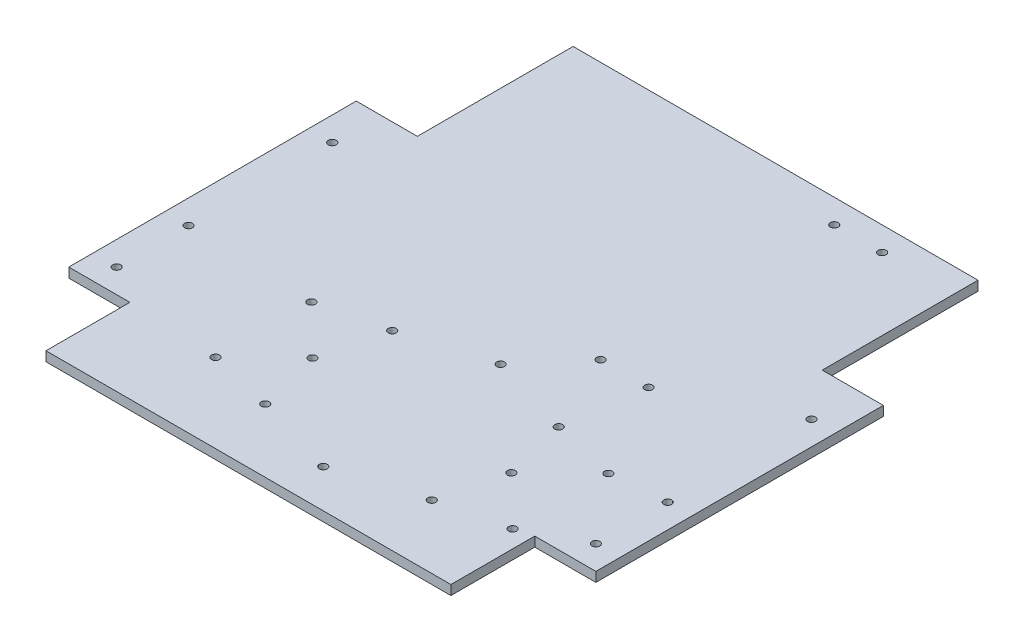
ISO-10303-21;
HEADER;
FILE_DESCRIPTION(('STEP AP214'),'2;1');
FILE_NAME('part.step','',(''),(''),'','','');
FILE_SCHEMA(('AUTOMOTIVE_DESIGN { 1 0 10303 214 1 1 1 1 }'));
ENDSEC;
DATA;
#1=APPLICATION_CONTEXT('core data for automotive mechanical design processes');
#2=APPLICATION_PROTOCOL_DEFINITION('international standard','automotive_design',2000,#1);
#3=PRODUCT_CONTEXT('',#1,'mechanical');
#4=PRODUCT('Part','Part','',(#3));
#5=PRODUCT_RELATED_PRODUCT_CATEGORY('part','',(#4));
#6=PRODUCT_DEFINITION_FORMATION('','',#4);
#7=PRODUCT_DEFINITION_CONTEXT('part definition',#1,'design');
#8=PRODUCT_DEFINITION('design','',#6,#7);
#9=PRODUCT_DEFINITION_SHAPE('','',#8);
#10=(LENGTH_UNIT() NAMED_UNIT(*) SI_UNIT(.MILLI.,.METRE.));
#11=(NAMED_UNIT(*) PLANE_ANGLE_UNIT() SI_UNIT($,.RADIAN.));
#12=(NAMED_UNIT(*) SI_UNIT($,.STERADIAN.) SOLID_ANGLE_UNIT());
#13=UNCERTAINTY_MEASURE_WITH_UNIT(LENGTH_MEASURE(1.E-05),#10,'distance_accuracy_value','');
#14=(GEOMETRIC_REPRESENTATION_CONTEXT(3) GLOBAL_UNCERTAINTY_ASSIGNED_CONTEXT((#13)) GLOBAL_UNIT_ASSIGNED_CONTEXT((#10,
#11,#12)) REPRESENTATION_CONTEXT('',''));
#15=CARTESIAN_POINT('',(0.,0.,0.));
#16=DIRECTION('',(0.,0.,1.));
#17=DIRECTION('',(1.,0.,0.));
#18=AXIS2_PLACEMENT_3D('',#15,#16,#17);
#19=CARTESIAN_POINT('',(84.5,-16.,0.));
#20=DIRECTION('',(-1.,0.,0.));
#21=DIRECTION('',(0.,1.,0.));
#22=AXIS2_PLACEMENT_3D('',#19,#20,#21);
#23=PLANE('',#22);
#24=DIRECTION('',(0.,0.,-1.));
#25=VECTOR('',#24,1.);
#26=CARTESIAN_POINT('',(84.5,0.,0.));
#27=LINE('',#26,#25);
#28=CARTESIAN_POINT('',(84.5,0.,-45.));
#29=VERTEX_POINT('',#28);
#30=CARTESIAN_POINT('',(84.5,0.,-110.));
#31=VERTEX_POINT('',#30);
#32=EDGE_CURVE('E271',#29,#31,#27,.T.);
#33=ORIENTED_EDGE('',*,*,#32,.T.);
#34=DIRECTION('',(0.,-1.,0.));
#35=VECTOR('',#34,1.);
#36=CARTESIAN_POINT('',(84.5,4.,-110.));
#37=LINE('',#36,#35);
#38=CARTESIAN_POINT('',(84.5,4.,-110.));
#39=VERTEX_POINT('',#38);
#40=EDGE_CURVE('E165',#39,#31,#37,.T.);
#41=ORIENTED_EDGE('',*,*,#40,.F.);
#42=DIRECTION('',(0.,0.,1.));
#43=VECTOR('',#42,1.);
#44=CARTESIAN_POINT('',(84.5,4.,0.));
#45=LINE('',#44,#43);
#46=CARTESIAN_POINT('',(84.5,4.,-45.));
#47=VERTEX_POINT('',#46);
#48=EDGE_CURVE('E206',#39,#47,#45,.T.);
#49=ORIENTED_EDGE('',*,*,#48,.T.);
#50=DIRECTION('',(0.,1.,0.));
#51=VECTOR('',#50,1.);
#52=CARTESIAN_POINT('',(84.5,-16.,-45.));
#53=LINE('',#52,#51);
#54=EDGE_CURVE('E11',#29,#47,#53,.T.);
#55=ORIENTED_EDGE('',*,*,#54,.F.);
#56=EDGE_LOOP('',(#33,#41,#49,#55));
#57=FACE_BOUND('',#56,.T.);
#58=ADVANCED_FACE('F17',(#57),#23,.F.);
#59=CARTESIAN_POINT('',(0.,-16.,-45.));
#60=DIRECTION('',(0.,0.,-1.));
#61=DIRECTION('',(0.,-1.,0.));
#62=AXIS2_PLACEMENT_3D('',#59,#60,#61);
#63=PLANE('',#62);
#64=ORIENTED_EDGE('',*,*,#54,.T.);
#65=DIRECTION('',(-1.,0.,0.));
#66=VECTOR('',#65,1.);
#67=CARTESIAN_POINT('',(0.,4.,-45.));
#68=LINE('',#67,#66);
#69=CARTESIAN_POINT('',(110.,4.,-45.));
#70=VERTEX_POINT('',#69);
#71=EDGE_CURVE('E281',#70,#47,#68,.T.);
#72=ORIENTED_EDGE('',*,*,#71,.F.);
#73=DIRECTION('',(0.,1.,0.));
#74=VECTOR('',#73,1.);
#75=CARTESIAN_POINT('',(110.,-16.,-45.));
#76=LINE('',#75,#74);
#77=CARTESIAN_POINT('',(110.,0.,-45.));
#78=VERTEX_POINT('',#77);
#79=EDGE_CURVE('E160',#78,#70,#76,.T.);
#80=ORIENTED_EDGE('',*,*,#79,.F.);
#81=DIRECTION('',(1.,0.,0.));
#82=VECTOR('',#81,1.);
#83=CARTESIAN_POINT('',(0.,0.,-45.));
#84=LINE('',#83,#82);
#85=EDGE_CURVE('E275',#29,#78,#84,.T.);
#86=ORIENTED_EDGE('',*,*,#85,.F.);
#87=EDGE_LOOP('',(#64,#72,#80,#86));
#88=FACE_BOUND('',#87,.T.);
#89=ADVANCED_FACE('F512',(#88),#63,.T.);
#90=CARTESIAN_POINT('',(0.,-16.,-45.));
#91=DIRECTION('',(0.,0.,1.));
#92=DIRECTION('',(1.,0.,0.));
#93=AXIS2_PLACEMENT_3D('',#90,#91,#92);
#94=PLANE('',#93);
#95=DIRECTION('',(-1.,0.,0.));
#96=VECTOR('',#95,1.);
#97=CARTESIAN_POINT('',(0.,0.,-45.));
#98=LINE('',#97,#96);
#99=CARTESIAN_POINT('',(-84.5,0.,-45.));
#100=VERTEX_POINT('',#99);
#101=CARTESIAN_POINT('',(-110.,0.,-45.));
#102=VERTEX_POINT('',#101);
#103=EDGE_CURVE('E133',#100,#102,#98,.T.);
#104=ORIENTED_EDGE('',*,*,#103,.T.);
#105=DIRECTION('',(0.,-1.,0.));
#106=VECTOR('',#105,1.);
#107=CARTESIAN_POINT('',(-110.,4.,-45.));
#108=LINE('',#107,#106);
#109=CARTESIAN_POINT('',(-110.,4.,-45.));
#110=VERTEX_POINT('',#109);
#111=EDGE_CURVE('E118',#110,#102,#108,.T.);
#112=ORIENTED_EDGE('',*,*,#111,.F.);
#113=DIRECTION('',(1.,0.,0.));
#114=VECTOR('',#113,1.);
#115=CARTESIAN_POINT('',(0.,4.,-45.));
#116=LINE('',#115,#114);
#117=CARTESIAN_POINT('',(-84.5,4.,-45.));
#118=VERTEX_POINT('',#117);
#119=EDGE_CURVE('E192',#110,#118,#116,.T.);
#120=ORIENTED_EDGE('',*,*,#119,.T.);
#121=DIRECTION('',(0.,1.,0.));
#122=VECTOR('',#121,1.);
#123=CARTESIAN_POINT('',(-84.5,-16.,-45.));
#124=LINE('',#123,#122);
#125=EDGE_CURVE('E26',#100,#118,#124,.T.);
#126=ORIENTED_EDGE('',*,*,#125,.F.);
#127=EDGE_LOOP('',(#104,#112,#120,#126));
#128=FACE_BOUND('',#127,.T.);
#129=ADVANCED_FACE('F134',(#128),#94,.F.);
#130=CARTESIAN_POINT('',(-84.5,-16.,0.));
#131=DIRECTION('',(-1.,0.,0.));
#132=DIRECTION('',(0.,0.,1.));
#133=AXIS2_PLACEMENT_3D('',#130,#131,#132);
#134=PLANE('',#133);
#135=ORIENTED_EDGE('',*,*,#125,.T.);
#136=DIRECTION('',(0.,0.,1.));
#137=VECTOR('',#136,1.);
#138=CARTESIAN_POINT('',(-84.5,4.,0.));
#139=LINE('',#138,#137);
#140=CARTESIAN_POINT('',(-84.5,4.,-110.));
#141=VERTEX_POINT('',#140);
#142=EDGE_CURVE('E188',#141,#118,#139,.T.);
#143=ORIENTED_EDGE('',*,*,#142,.F.);
#144=DIRECTION('',(0.,1.,0.));
#145=VECTOR('',#144,1.);
#146=CARTESIAN_POINT('',(-84.5,-16.,-110.));
#147=LINE('',#146,#145);
#148=CARTESIAN_POINT('',(-84.5,0.,-110.));
#149=VERTEX_POINT('',#148);
#150=EDGE_CURVE('E40',#149,#141,#147,.T.);
#151=ORIENTED_EDGE('',*,*,#150,.F.);
#152=DIRECTION('',(0.,0.,-1.));
#153=VECTOR('',#152,1.);
#154=CARTESIAN_POINT('',(-84.5,0.,0.));
#155=LINE('',#154,#153);
#156=EDGE_CURVE('E139',#100,#149,#155,.T.);
#157=ORIENTED_EDGE('',*,*,#156,.F.);
#158=EDGE_LOOP('',(#135,#143,#151,#157));
#159=FACE_BOUND('',#158,.T.);
#160=ADVANCED_FACE('F186',(#159),#134,.T.);
#161=CARTESIAN_POINT('',(-84.5,-16.,0.));
#162=DIRECTION('',(1.,0.,0.));
#163=DIRECTION('',(0.,0.,-1.));
#164=AXIS2_PLACEMENT_3D('',#161,#162,#163);
#165=PLANE('',#164);
#166=DIRECTION('',(0.,0.,1.));
#167=VECTOR('',#166,1.);
#168=CARTESIAN_POINT('',(-84.5,0.,0.));
#169=LINE('',#168,#167);
#170=CARTESIAN_POINT('',(-84.5,0.,75.));
#171=VERTEX_POINT('',#170);
#172=CARTESIAN_POINT('',(-84.5,0.,110.));
#173=VERTEX_POINT('',#172);
#174=EDGE_CURVE('E151',#171,#173,#169,.T.);
#175=ORIENTED_EDGE('',*,*,#174,.T.);
#176=DIRECTION('',(0.,-1.,0.));
#177=VECTOR('',#176,1.);
#178=CARTESIAN_POINT('',(-84.5,4.,110.));
#179=LINE('',#178,#177);
#180=CARTESIAN_POINT('',(-84.5,4.,110.));
#181=VERTEX_POINT('',#180);
#182=EDGE_CURVE('E130',#181,#173,#179,.T.);
#183=ORIENTED_EDGE('',*,*,#182,.F.);
#184=DIRECTION('',(0.,0.,-1.));
#185=VECTOR('',#184,1.);
#186=CARTESIAN_POINT('',(-84.5,4.,0.));
#187=LINE('',#186,#185);
#188=CARTESIAN_POINT('',(-84.5,4.,75.));
#189=VERTEX_POINT('',#188);
#190=EDGE_CURVE('E310',#181,#189,#187,.T.);
#191=ORIENTED_EDGE('',*,*,#190,.T.);
#192=DIRECTION('',(0.,1.,0.));
#193=VECTOR('',#192,1.);
#194=CARTESIAN_POINT('',(-84.5,-16.,75.));
#195=LINE('',#194,#193);
#196=EDGE_CURVE('E181',#171,#189,#195,.T.);
#197=ORIENTED_EDGE('',*,*,#196,.F.);
#198=EDGE_LOOP('',(#175,#183,#191,#197));
#199=FACE_BOUND('',#198,.T.);
#200=ADVANCED_FACE('F337',(#199),#165,.F.);
#201=CARTESIAN_POINT('',(0.,-16.,75.));
#202=DIRECTION('',(0.,0.,1.));
#203=DIRECTION('',(1.,0.,0.));
#204=AXIS2_PLACEMENT_3D('',#201,#202,#203);
#205=PLANE('',#204);
#206=ORIENTED_EDGE('',*,*,#196,.T.);
#207=DIRECTION('',(1.,0.,0.));
#208=VECTOR('',#207,1.);
#209=CARTESIAN_POINT('',(0.,4.,75.));
#210=LINE('',#209,#208);
#211=CARTESIAN_POINT('',(-110.,4.,75.));
#212=VERTEX_POINT('',#211);
#213=EDGE_CURVE('E306',#212,#189,#210,.T.);
#214=ORIENTED_EDGE('',*,*,#213,.F.);
#215=DIRECTION('',(0.,1.,0.));
#216=VECTOR('',#215,1.);
#217=CARTESIAN_POINT('',(-110.,-16.,75.));
#218=LINE('',#217,#216);
#219=CARTESIAN_POINT('',(-110.,0.,75.));
#220=VERTEX_POINT('',#219);
#221=EDGE_CURVE('E110',#220,#212,#218,.T.);
#222=ORIENTED_EDGE('',*,*,#221,.F.);
#223=DIRECTION('',(-1.,0.,0.));
#224=VECTOR('',#223,1.);
#225=CARTESIAN_POINT('',(0.,0.,75.));
#226=LINE('',#225,#224);
#227=EDGE_CURVE('E144',#171,#220,#226,.T.);
#228=ORIENTED_EDGE('',*,*,#227,.F.);
#229=EDGE_LOOP('',(#206,#214,#222,#228));
#230=FACE_BOUND('',#229,.T.);
#231=ADVANCED_FACE('F539',(#230),#205,.T.);
#232=CARTESIAN_POINT('',(0.,-16.,75.));
#233=DIRECTION('',(0.,0.,-1.));
#234=DIRECTION('',(0.,-1.,0.));
#235=AXIS2_PLACEMENT_3D('',#232,#233,#234);
#236=PLANE('',#235);
#237=DIRECTION('',(1.,0.,0.));
#238=VECTOR('',#237,1.);
#239=CARTESIAN_POINT('',(0.,0.,75.));
#240=LINE('',#239,#238);
#241=CARTESIAN_POINT('',(84.5,0.,75.));
#242=VERTEX_POINT('',#241);
#243=CARTESIAN_POINT('',(110.,0.,75.));
#244=VERTEX_POINT('',#243);
#245=EDGE_CURVE('E328',#242,#244,#240,.T.);
#246=ORIENTED_EDGE('',*,*,#245,.T.);
#247=DIRECTION('',(0.,1.,0.));
#248=VECTOR('',#247,1.);
#249=CARTESIAN_POINT('',(110.,-16.,75.));
#250=LINE('',#249,#248);
#251=CARTESIAN_POINT('',(110.,4.,75.));
#252=VERTEX_POINT('',#251);
#253=EDGE_CURVE('E161',#244,#252,#250,.T.);
#254=ORIENTED_EDGE('',*,*,#253,.T.);
#255=DIRECTION('',(-1.,0.,0.));
#256=VECTOR('',#255,1.);
#257=CARTESIAN_POINT('',(0.,4.,75.));
#258=LINE('',#257,#256);
#259=CARTESIAN_POINT('',(84.5,4.,75.));
#260=VERTEX_POINT('',#259);
#261=EDGE_CURVE('E370',#252,#260,#258,.T.);
#262=ORIENTED_EDGE('',*,*,#261,.T.);
#263=DIRECTION('',(0.,1.,0.));
#264=VECTOR('',#263,1.);
#265=CARTESIAN_POINT('',(84.5,-16.,75.));
#266=LINE('',#265,#264);
#267=EDGE_CURVE('E178',#242,#260,#266,.T.);
#268=ORIENTED_EDGE('',*,*,#267,.F.);
#269=EDGE_LOOP('',(#246,#254,#262,#268));
#270=FACE_BOUND('',#269,.T.);
#271=ADVANCED_FACE('F368',(#270),#236,.F.);
#272=CARTESIAN_POINT('',(84.5,-16.,0.));
#273=DIRECTION('',(1.,0.,0.));
#274=DIRECTION('',(0.,1.,0.));
#275=AXIS2_PLACEMENT_3D('',#272,#273,#274);
#276=PLANE('',#275);
#277=ORIENTED_EDGE('',*,*,#267,.T.);
#278=DIRECTION('',(0.,0.,-1.));
#279=VECTOR('',#278,1.);
#280=CARTESIAN_POINT('',(84.5,4.,0.));
#281=LINE('',#280,#279);
#282=CARTESIAN_POINT('',(84.5,4.,110.));
#283=VERTEX_POINT('',#282);
#284=EDGE_CURVE('E318',#283,#260,#281,.T.);
#285=ORIENTED_EDGE('',*,*,#284,.F.);
#286=DIRECTION('',(0.,-1.,0.));
#287=VECTOR('',#286,1.);
#288=CARTESIAN_POINT('',(84.5,4.,110.));
#289=LINE('',#288,#287);
#290=CARTESIAN_POINT('',(84.5,0.,110.));
#291=VERTEX_POINT('',#290);
#292=EDGE_CURVE('E174',#283,#291,#289,.T.);
#293=ORIENTED_EDGE('',*,*,#292,.T.);
#294=DIRECTION('',(0.,0.,1.));
#295=VECTOR('',#294,1.);
#296=CARTESIAN_POINT('',(84.5,0.,0.));
#297=LINE('',#296,#295);
#298=EDGE_CURVE('E323',#242,#291,#297,.T.);
#299=ORIENTED_EDGE('',*,*,#298,.F.);
#300=EDGE_LOOP('',(#277,#285,#293,#299));
#301=FACE_BOUND('',#300,.T.);
#302=ADVANCED_FACE('F534',(#301),#276,.T.);
#303=CARTESIAN_POINT('',(-110.,4.,110.));
#304=DIRECTION('',(0.,0.,-1.));
#305=DIRECTION('',(0.,-1.,0.));
#306=AXIS2_PLACEMENT_3D('',#303,#304,#305);
#307=PLANE('',#306);
#308=DIRECTION('',(1.,0.,0.));
#309=VECTOR('',#308,1.);
#310=CARTESIAN_POINT('',(-110.,4.,110.));
#311=LINE('',#310,#309);
#312=EDGE_CURVE('E314',#181,#283,#311,.T.);
#313=ORIENTED_EDGE('',*,*,#312,.F.);
#314=ORIENTED_EDGE('',*,*,#182,.T.);
#315=DIRECTION('',(1.,0.,0.));
#316=VECTOR('',#315,1.);
#317=CARTESIAN_POINT('',(-110.,0.,110.));
#318=LINE('',#317,#316);
#319=EDGE_CURVE('E327',#173,#291,#318,.T.);
#320=ORIENTED_EDGE('',*,*,#319,.T.);
#321=ORIENTED_EDGE('',*,*,#292,.F.);
#322=EDGE_LOOP('',(#313,#314,#320,#321));
#323=FACE_BOUND('',#322,.T.);
#324=ADVANCED_FACE('F342',(#323),#307,.F.);
#325=CARTESIAN_POINT('',(-110.,4.,110.));
#326=DIRECTION('',(1.,0.,0.));
#327=DIRECTION('',(0.,1.,0.));
#328=AXIS2_PLACEMENT_3D('',#325,#326,#327);
#329=PLANE('',#328);
#330=ORIENTED_EDGE('',*,*,#221,.T.);
#331=DIRECTION('',(0.,0.,1.));
#332=VECTOR('',#331,1.);
#333=CARTESIAN_POINT('',(-110.,4.,110.));
#334=LINE('',#333,#332);
#335=EDGE_CURVE('E125',#110,#212,#334,.T.);
#336=ORIENTED_EDGE('',*,*,#335,.F.);
#337=ORIENTED_EDGE('',*,*,#111,.T.);
#338=DIRECTION('',(0.,0.,1.));
#339=VECTOR('',#338,1.);
#340=CARTESIAN_POINT('',(-110.,0.,110.));
#341=LINE('',#340,#339);
#342=EDGE_CURVE('E122',#102,#220,#341,.T.);
#343=ORIENTED_EDGE('',*,*,#342,.T.);
#344=EDGE_LOOP('',(#330,#336,#337,#343));
#345=FACE_BOUND('',#344,.T.);
#346=ADVANCED_FACE('F120',(#345),#329,.F.);
#347=CARTESIAN_POINT('',(-110.,4.,-110.));
#348=DIRECTION('',(0.,0.,1.));
#349=DIRECTION('',(1.,0.,0.));
#350=AXIS2_PLACEMENT_3D('',#347,#348,#349);
#351=PLANE('',#350);
#352=DIRECTION('',(-1.,0.,0.));
#353=VECTOR('',#352,1.);
#354=CARTESIAN_POINT('',(-110.,4.,-110.));
#355=LINE('',#354,#353);
#356=EDGE_CURVE('E200',#39,#141,#355,.T.);
#357=ORIENTED_EDGE('',*,*,#356,.F.);
#358=ORIENTED_EDGE('',*,*,#40,.T.);
#359=DIRECTION('',(-1.,0.,0.));
#360=VECTOR('',#359,1.);
#361=CARTESIAN_POINT('',(-110.,0.,-110.));
#362=LINE('',#361,#360);
#363=EDGE_CURVE('E157',#31,#149,#362,.T.);
#364=ORIENTED_EDGE('',*,*,#363,.T.);
#365=ORIENTED_EDGE('',*,*,#150,.T.);
#366=EDGE_LOOP('',(#357,#358,#364,#365));
#367=FACE_BOUND('',#366,.T.);
#368=ADVANCED_FACE('F521',(#367),#351,.F.);
#369=CARTESIAN_POINT('',(110.,4.,110.));
#370=DIRECTION('',(-1.,0.,0.));
#371=DIRECTION('',(0.,0.,1.));
#372=AXIS2_PLACEMENT_3D('',#369,#370,#371);
#373=PLANE('',#372);
#374=ORIENTED_EDGE('',*,*,#79,.T.);
#375=DIRECTION('',(0.,0.,-1.));
#376=VECTOR('',#375,1.);
#377=CARTESIAN_POINT('',(110.,4.,110.));
#378=LINE('',#377,#376);
#379=EDGE_CURVE('E276',#252,#70,#378,.T.);
#380=ORIENTED_EDGE('',*,*,#379,.F.);
#381=ORIENTED_EDGE('',*,*,#253,.F.);
#382=DIRECTION('',(0.,0.,-1.));
#383=VECTOR('',#382,1.);
#384=CARTESIAN_POINT('',(110.,0.,110.));
#385=LINE('',#384,#383);
#386=EDGE_CURVE('E322',#244,#78,#385,.T.);
#387=ORIENTED_EDGE('',*,*,#386,.T.);
#388=EDGE_LOOP('',(#374,#380,#381,#387));
#389=FACE_BOUND('',#388,.T.);
#390=ADVANCED_FACE('F376',(#389),#373,.F.);
#391=CARTESIAN_POINT('',(0.,0.,0.));
#392=DIRECTION('',(0.,-1.,0.));
#393=DIRECTION('',(0.,0.,-1.));
#394=AXIS2_PLACEMENT_3D('',#391,#392,#393);
#395=PLANE('',#394);
#396=CARTESIAN_POINT('',(-100.,0.,35.));
#397=DIRECTION('',(0.,1.,0.));
#398=DIRECTION('',(0.,0.,1.));
#399=AXIS2_PLACEMENT_3D('',#396,#397,#398);
#400=CIRCLE('',#399,1.65);
#401=CARTESIAN_POINT('',(-100.,0.,36.65));
#402=VERTEX_POINT('',#401);
#403=EDGE_CURVE('E280',#402,#402,#400,.T.);
#404=ORIENTED_EDGE('',*,*,#403,.T.);
#405=EDGE_LOOP('',(#404));
#406=FACE_BOUND('',#405,.T.);
#407=CARTESIAN_POINT('',(100.,0.,-25.));
#408=DIRECTION('',(0.,1.,0.));
#409=DIRECTION('',(0.,0.,1.));
#410=AXIS2_PLACEMENT_3D('',#407,#408,#409);
#411=CIRCLE('',#410,1.65);
#412=CARTESIAN_POINT('',(100.,0.,-23.35));
#413=VERTEX_POINT('',#412);
#414=EDGE_CURVE('E291',#413,#413,#411,.T.);
#415=ORIENTED_EDGE('',*,*,#414,.T.);
#416=EDGE_LOOP('',(#415));
#417=FACE_BOUND('',#416,.T.);
#418=CARTESIAN_POINT('',(-100.,0.,65.));
#419=DIRECTION('',(0.,1.,0.));
#420=DIRECTION('',(0.,0.,1.));
#421=AXIS2_PLACEMENT_3D('',#418,#419,#420);
#422=CIRCLE('',#421,1.65);
#423=CARTESIAN_POINT('',(-100.,0.,66.65));
#424=VERTEX_POINT('',#423);
#425=EDGE_CURVE('E221',#424,#424,#422,.T.);
#426=ORIENTED_EDGE('',*,*,#425,.T.);
#427=EDGE_LOOP('',(#426));
#428=FACE_BOUND('',#427,.T.);
#429=CARTESIAN_POINT('',(-100.,0.,-25.));
#430=DIRECTION('',(0.,1.,0.));
#431=DIRECTION('',(0.,0.,1.));
#432=AXIS2_PLACEMENT_3D('',#429,#430,#431);
#433=CIRCLE('',#432,1.65);
#434=CARTESIAN_POINT('',(-100.,0.,-23.35));
#435=VERTEX_POINT('',#434);
#436=EDGE_CURVE('E284',#435,#435,#433,.T.);
#437=ORIENTED_EDGE('',*,*,#436,.T.);
#438=EDGE_LOOP('',(#437));
#439=FACE_BOUND('',#438,.T.);
#440=CARTESIAN_POINT('',(100.,0.,65.));
#441=DIRECTION('',(0.,1.,0.));
#442=DIRECTION('',(0.,0.,1.));
#443=AXIS2_PLACEMENT_3D('',#440,#441,#442);
#444=CIRCLE('',#443,1.65);
#445=CARTESIAN_POINT('',(100.,0.,66.65));
#446=VERTEX_POINT('',#445);
#447=EDGE_CURVE('E222',#446,#446,#444,.T.);
#448=ORIENTED_EDGE('',*,*,#447,.T.);
#449=EDGE_LOOP('',(#448));
#450=FACE_BOUND('',#449,.T.);
#451=CARTESIAN_POINT('',(100.,0.,35.));
#452=DIRECTION('',(0.,1.,0.));
#453=DIRECTION('',(0.,0.,1.));
#454=AXIS2_PLACEMENT_3D('',#451,#452,#453);
#455=CIRCLE('',#454,1.65);
#456=CARTESIAN_POINT('',(100.,0.,36.65));
#457=VERTEX_POINT('',#456);
#458=EDGE_CURVE('E257',#457,#457,#455,.T.);
#459=ORIENTED_EDGE('',*,*,#458,.T.);
#460=EDGE_LOOP('',(#459));
#461=FACE_BOUND('',#460,.T.);
#462=CARTESIAN_POINT('',(-19.5,0.,30.5));
#463=DIRECTION('',(0.,1.,0.));
#464=DIRECTION('',(0.,0.,1.));
#465=AXIS2_PLACEMENT_3D('',#462,#463,#464);
#466=CIRCLE('',#465,1.65);
#467=CARTESIAN_POINT('',(-19.5,0.,32.15));
#468=VERTEX_POINT('',#467);
#469=EDGE_CURVE('E256',#468,#468,#466,.T.);
#470=ORIENTED_EDGE('',*,*,#469,.T.);
#471=EDGE_LOOP('',(#470));
#472=FACE_BOUND('',#471,.T.);
#473=CARTESIAN_POINT('',(15.25,0.,94.));
#474=DIRECTION('',(0.,1.,0.));
#475=DIRECTION('',(0.,0.,1.));
#476=AXIS2_PLACEMENT_3D('',#473,#474,#475);
#477=CIRCLE('',#476,1.65);
#478=CARTESIAN_POINT('',(15.25,0.,95.65));
#479=VERTEX_POINT('',#478);
#480=EDGE_CURVE('E248',#479,#479,#477,.T.);
#481=ORIENTED_EDGE('',*,*,#480,.T.);
#482=EDGE_LOOP('',(#481));
#483=FACE_BOUND('',#482,.T.);
#484=CARTESIAN_POINT('',(-19.5,0.,83.5));
#485=DIRECTION('',(0.,1.,0.));
#486=DIRECTION('',(0.,0.,1.));
#487=AXIS2_PLACEMENT_3D('',#484,#485,#486);
#488=CIRCLE('',#487,1.65);
#489=CARTESIAN_POINT('',(-19.5,0.,85.15));
#490=VERTEX_POINT('',#489);
#491=EDGE_CURVE('E243',#490,#490,#488,.T.);
#492=ORIENTED_EDGE('',*,*,#491,.T.);
#493=EDGE_LOOP('',(#492));
#494=FACE_BOUND('',#493,.T.);
#495=CARTESIAN_POINT('',(50.,0.,30.5));
#496=DIRECTION('',(0.,1.,0.));
#497=DIRECTION('',(0.,0.,1.));
#498=AXIS2_PLACEMENT_3D('',#495,#496,#497);
#499=CIRCLE('',#498,1.65);
#500=CARTESIAN_POINT('',(50.,0.,32.15));
#501=VERTEX_POINT('',#500);
#502=EDGE_CURVE('E235',#501,#501,#499,.T.);
#503=ORIENTED_EDGE('',*,*,#502,.T.);
#504=EDGE_LOOP('',(#503));
#505=FACE_BOUND('',#504,.T.);
#506=CARTESIAN_POINT('',(-26.25,0.,57.));
#507=DIRECTION('',(0.,1.,0.));
#508=DIRECTION('',(0.,0.,1.));
#509=AXIS2_PLACEMENT_3D('',#506,#507,#508);
#510=CIRCLE('',#509,1.65);
#511=CARTESIAN_POINT('',(-26.25,0.,58.65));
#512=VERTEX_POINT('',#511);
#513=EDGE_CURVE('E230',#512,#512,#510,.T.);
#514=ORIENTED_EDGE('',*,*,#513,.T.);
#515=EDGE_LOOP('',(#514));
#516=FACE_BOUND('',#515,.T.);
#517=CARTESIAN_POINT('',(56.75,0.,57.));
#518=DIRECTION('',(0.,1.,0.));
#519=DIRECTION('',(0.,0.,1.));
#520=AXIS2_PLACEMENT_3D('',#517,#518,#519);
#521=CIRCLE('',#520,1.65);
#522=CARTESIAN_POINT('',(56.75,0.,58.65));
#523=VERTEX_POINT('',#522);
#524=EDGE_CURVE('E216',#523,#523,#521,.T.);
#525=ORIENTED_EDGE('',*,*,#524,.T.);
#526=EDGE_LOOP('',(#525));
#527=FACE_BOUND('',#526,.T.);
#528=CARTESIAN_POINT('',(50.,0.,83.5));
#529=DIRECTION('',(0.,1.,0.));
#530=DIRECTION('',(0.,0.,1.));
#531=AXIS2_PLACEMENT_3D('',#528,#529,#530);
#532=CIRCLE('',#531,1.65);
#533=CARTESIAN_POINT('',(50.,0.,85.15));
#534=VERTEX_POINT('',#533);
#535=EDGE_CURVE('E210',#534,#534,#532,.T.);
#536=ORIENTED_EDGE('',*,*,#535,.T.);
#537=EDGE_LOOP('',(#536));
#538=FACE_BOUND('',#537,.T.);
#539=CARTESIAN_POINT('',(15.25,0.,20.));
#540=DIRECTION('',(0.,1.,0.));
#541=DIRECTION('',(0.,0.,1.));
#542=AXIS2_PLACEMENT_3D('',#539,#540,#541);
#543=CIRCLE('',#542,1.65);
#544=CARTESIAN_POINT('',(15.25,0.,21.65));
#545=VERTEX_POINT('',#544);
#546=EDGE_CURVE('E416',#545,#545,#543,.T.);
#547=ORIENTED_EDGE('',*,*,#546,.T.);
#548=EDGE_LOOP('',(#547));
#549=FACE_BOUND('',#548,.T.);
#550=CARTESIAN_POINT('',(34.5,0.,-100.));
#551=DIRECTION('',(0.,1.,0.));
#552=DIRECTION('',(0.,0.,1.));
#553=AXIS2_PLACEMENT_3D('',#550,#551,#552);
#554=CIRCLE('',#553,1.65);
#555=CARTESIAN_POINT('',(34.5,0.,-98.35));
#556=VERTEX_POINT('',#555);
#557=EDGE_CURVE('E464',#556,#556,#554,.T.);
#558=ORIENTED_EDGE('',*,*,#557,.T.);
#559=EDGE_LOOP('',(#558));
#560=FACE_BOUND('',#559,.T.);
#561=CARTESIAN_POINT('',(54.5,0.,-100.));
#562=DIRECTION('',(0.,1.,0.));
#563=DIRECTION('',(0.,0.,1.));
#564=AXIS2_PLACEMENT_3D('',#561,#562,#563);
#565=CIRCLE('',#564,1.65);
#566=CARTESIAN_POINT('',(54.5,0.,-98.35));
#567=VERTEX_POINT('',#566);
#568=EDGE_CURVE('E453',#567,#567,#565,.T.);
#569=ORIENTED_EDGE('',*,*,#568,.T.);
#570=EDGE_LOOP('',(#569));
#571=FACE_BOUND('',#570,.T.);
#572=CARTESIAN_POINT('',(54.5,0.,-2.5));
#573=DIRECTION('',(0.,1.,0.));
#574=DIRECTION('',(0.,0.,1.));
#575=AXIS2_PLACEMENT_3D('',#572,#573,#574);
#576=CIRCLE('',#575,1.65);
#577=CARTESIAN_POINT('',(54.5,0.,-0.85));
#578=VERTEX_POINT('',#577);
#579=EDGE_CURVE('E396',#578,#578,#576,.T.);
#580=ORIENTED_EDGE('',*,*,#579,.T.);
#581=EDGE_LOOP('',(#580));
#582=FACE_BOUND('',#581,.T.);
#583=CARTESIAN_POINT('',(34.5,0.,-2.5));
#584=DIRECTION('',(0.,1.,0.));
#585=DIRECTION('',(0.,0.,1.));
#586=AXIS2_PLACEMENT_3D('',#583,#584,#585);
#587=CIRCLE('',#586,1.65);
#588=CARTESIAN_POINT('',(34.5,0.,-0.85));
#589=VERTEX_POINT('',#588);
#590=EDGE_CURVE('E402',#589,#589,#587,.T.);
#591=ORIENTED_EDGE('',*,*,#590,.T.);
#592=EDGE_LOOP('',(#591));
#593=FACE_BOUND('',#592,.T.);
#594=CARTESIAN_POINT('',(77.25,0.,37.));
#595=DIRECTION('',(0.,-1.,0.));
#596=DIRECTION('',(0.,0.,-1.));
#597=AXIS2_PLACEMENT_3D('',#594,#595,#596);
#598=CIRCLE('',#597,1.65);
#599=CARTESIAN_POINT('',(77.25,0.,35.35));
#600=VERTEX_POINT('',#599);
#601=EDGE_CURVE('E407',#600,#600,#598,.T.);
#602=ORIENTED_EDGE('',*,*,#601,.F.);
#603=EDGE_LOOP('',(#602));
#604=FACE_BOUND('',#603,.T.);
#605=CARTESIAN_POINT('',(77.25,0.,77.));
#606=DIRECTION('',(0.,-1.,0.));
#607=DIRECTION('',(0.,0.,-1.));
#608=AXIS2_PLACEMENT_3D('',#605,#606,#607);
#609=CIRCLE('',#608,1.65);
#610=CARTESIAN_POINT('',(77.25,0.,75.35));
#611=VERTEX_POINT('',#610);
#612=EDGE_CURVE('E427',#611,#611,#609,.T.);
#613=ORIENTED_EDGE('',*,*,#612,.F.);
#614=EDGE_LOOP('',(#613));
#615=FACE_BOUND('',#614,.T.);
#616=CARTESIAN_POINT('',(-46.75,0.,77.));
#617=DIRECTION('',(0.,-1.,0.));
#618=DIRECTION('',(0.,0.,-1.));
#619=AXIS2_PLACEMENT_3D('',#616,#617,#618);
#620=CIRCLE('',#619,1.65);
#621=CARTESIAN_POINT('',(-46.75,0.,75.35));
#622=VERTEX_POINT('',#621);
#623=EDGE_CURVE('E411',#622,#622,#620,.T.);
#624=ORIENTED_EDGE('',*,*,#623,.F.);
#625=EDGE_LOOP('',(#624));
#626=FACE_BOUND('',#625,.T.);
#627=CARTESIAN_POINT('',(-46.75,0.,37.));
#628=DIRECTION('',(0.,-1.,0.));
#629=DIRECTION('',(0.,0.,-1.));
#630=AXIS2_PLACEMENT_3D('',#627,#628,#629);
#631=CIRCLE('',#630,1.65);
#632=CARTESIAN_POINT('',(-46.75,0.,35.35));
#633=VERTEX_POINT('',#632);
#634=EDGE_CURVE('E389',#633,#633,#631,.T.);
#635=ORIENTED_EDGE('',*,*,#634,.F.);
#636=EDGE_LOOP('',(#635));
#637=FACE_BOUND('',#636,.T.);
#638=ORIENTED_EDGE('',*,*,#32,.F.);
#639=ORIENTED_EDGE('',*,*,#85,.T.);
#640=ORIENTED_EDGE('',*,*,#386,.F.);
#641=ORIENTED_EDGE('',*,*,#245,.F.);
#642=ORIENTED_EDGE('',*,*,#298,.T.);
#643=ORIENTED_EDGE('',*,*,#319,.F.);
#644=ORIENTED_EDGE('',*,*,#174,.F.);
#645=ORIENTED_EDGE('',*,*,#227,.T.);
#646=ORIENTED_EDGE('',*,*,#342,.F.);
#647=ORIENTED_EDGE('',*,*,#103,.F.);
#648=ORIENTED_EDGE('',*,*,#156,.T.);
#649=ORIENTED_EDGE('',*,*,#363,.F.);
#650=EDGE_LOOP('',(#638,#639,#640,#641,#642,#643,#644,#645,#646,#647,#648,#649));
#651=FACE_BOUND('',#650,.T.);
#652=ADVANCED_FACE('F142',(#406,#417,#428,#439,#450,#461,#472,#483,#494,#505,#516,#527,#538,
#549,#560,#571,#582,#593,#604,#615,#626,#637,#651),#395,.T.);
#653=CARTESIAN_POINT('',(0.,4.,0.));
#654=DIRECTION('',(0.,-1.,0.));
#655=DIRECTION('',(0.,0.,-1.));
#656=AXIS2_PLACEMENT_3D('',#653,#654,#655);
#657=PLANE('',#656);
#658=CARTESIAN_POINT('',(-100.,4.,35.));
#659=DIRECTION('',(0.,1.,0.));
#660=DIRECTION('',(0.,0.,1.));
#661=AXIS2_PLACEMENT_3D('',#658,#659,#660);
#662=CIRCLE('',#661,1.65);
#663=CARTESIAN_POINT('',(-100.,4.,36.65));
#664=VERTEX_POINT('',#663);
#665=EDGE_CURVE('E270',#664,#664,#662,.T.);
#666=ORIENTED_EDGE('',*,*,#665,.F.);
#667=EDGE_LOOP('',(#666));
#668=FACE_BOUND('',#667,.T.);
#669=CARTESIAN_POINT('',(100.,4.,35.));
#670=DIRECTION('',(0.,1.,0.));
#671=DIRECTION('',(0.,0.,1.));
#672=AXIS2_PLACEMENT_3D('',#669,#670,#671);
#673=CIRCLE('',#672,1.65);
#674=CARTESIAN_POINT('',(100.,4.,36.65));
#675=VERTEX_POINT('',#674);
#676=EDGE_CURVE('E262',#675,#675,#673,.T.);
#677=ORIENTED_EDGE('',*,*,#676,.F.);
#678=EDGE_LOOP('',(#677));
#679=FACE_BOUND('',#678,.T.);
#680=CARTESIAN_POINT('',(100.,4.,-25.));
#681=DIRECTION('',(0.,1.,0.));
#682=DIRECTION('',(0.,0.,1.));
#683=AXIS2_PLACEMENT_3D('',#680,#681,#682);
#684=CIRCLE('',#683,1.65);
#685=CARTESIAN_POINT('',(100.,4.,-23.35));
#686=VERTEX_POINT('',#685);
#687=EDGE_CURVE('E261',#686,#686,#684,.T.);
#688=ORIENTED_EDGE('',*,*,#687,.F.);
#689=EDGE_LOOP('',(#688));
#690=FACE_BOUND('',#689,.T.);
#691=CARTESIAN_POINT('',(100.,4.,65.));
#692=DIRECTION('',(0.,1.,0.));
#693=DIRECTION('',(0.,0.,1.));
#694=AXIS2_PLACEMENT_3D('',#691,#692,#693);
#695=CIRCLE('',#694,1.65);
#696=CARTESIAN_POINT('',(100.,4.,66.65));
#697=VERTEX_POINT('',#696);
#698=EDGE_CURVE('E292',#697,#697,#695,.T.);
#699=ORIENTED_EDGE('',*,*,#698,.F.);
#700=EDGE_LOOP('',(#699));
#701=FACE_BOUND('',#700,.T.);
#702=CARTESIAN_POINT('',(-100.,4.,65.));
#703=DIRECTION('',(0.,1.,0.));
#704=DIRECTION('',(0.,0.,1.));
#705=AXIS2_PLACEMENT_3D('',#702,#703,#704);
#706=CIRCLE('',#705,1.65);
#707=CARTESIAN_POINT('',(-100.,4.,66.65));
#708=VERTEX_POINT('',#707);
#709=EDGE_CURVE('E217',#708,#708,#706,.T.);
#710=ORIENTED_EDGE('',*,*,#709,.F.);
#711=EDGE_LOOP('',(#710));
#712=FACE_BOUND('',#711,.T.);
#713=CARTESIAN_POINT('',(-100.,4.,-25.));
#714=DIRECTION('',(0.,1.,0.));
#715=DIRECTION('',(0.,0.,1.));
#716=AXIS2_PLACEMENT_3D('',#713,#714,#715);
#717=CIRCLE('',#716,1.65);
#718=CARTESIAN_POINT('',(-100.,4.,-23.35));
#719=VERTEX_POINT('',#718);
#720=EDGE_CURVE('E302',#719,#719,#717,.T.);
#721=ORIENTED_EDGE('',*,*,#720,.F.);
#722=EDGE_LOOP('',(#721));
#723=FACE_BOUND('',#722,.T.);
#724=CARTESIAN_POINT('',(-19.5,4.,30.5));
#725=DIRECTION('',(0.,1.,0.));
#726=DIRECTION('',(0.,0.,1.));
#727=AXIS2_PLACEMENT_3D('',#724,#725,#726);
#728=CIRCLE('',#727,1.65);
#729=CARTESIAN_POINT('',(-19.5,4.,32.15));
#730=VERTEX_POINT('',#729);
#731=EDGE_CURVE('E266',#730,#730,#728,.T.);
#732=ORIENTED_EDGE('',*,*,#731,.F.);
#733=EDGE_LOOP('',(#732));
#734=FACE_BOUND('',#733,.T.);
#735=CARTESIAN_POINT('',(15.25,4.,94.));
#736=DIRECTION('',(0.,1.,0.));
#737=DIRECTION('',(0.,0.,1.));
#738=AXIS2_PLACEMENT_3D('',#735,#736,#737);
#739=CIRCLE('',#738,1.65);
#740=CARTESIAN_POINT('',(15.25,4.,95.65));
#741=VERTEX_POINT('',#740);
#742=EDGE_CURVE('E252',#741,#741,#739,.T.);
#743=ORIENTED_EDGE('',*,*,#742,.F.);
#744=EDGE_LOOP('',(#743));
#745=FACE_BOUND('',#744,.T.);
#746=CARTESIAN_POINT('',(-19.5,4.,83.5));
#747=DIRECTION('',(0.,1.,0.));
#748=DIRECTION('',(0.,0.,1.));
#749=AXIS2_PLACEMENT_3D('',#746,#747,#748);
#750=CIRCLE('',#749,1.65);
#751=CARTESIAN_POINT('',(-19.5,4.,85.15));
#752=VERTEX_POINT('',#751);
#753=EDGE_CURVE('E244',#752,#752,#750,.T.);
#754=ORIENTED_EDGE('',*,*,#753,.F.);
#755=EDGE_LOOP('',(#754));
#756=FACE_BOUND('',#755,.T.);
#757=CARTESIAN_POINT('',(50.,4.,30.5));
#758=DIRECTION('',(0.,1.,0.));
#759=DIRECTION('',(0.,0.,1.));
#760=AXIS2_PLACEMENT_3D('',#757,#758,#759);
#761=CIRCLE('',#760,1.65);
#762=CARTESIAN_POINT('',(50.,4.,32.15));
#763=VERTEX_POINT('',#762);
#764=EDGE_CURVE('E239',#763,#763,#761,.T.);
#765=ORIENTED_EDGE('',*,*,#764,.F.);
#766=EDGE_LOOP('',(#765));
#767=FACE_BOUND('',#766,.T.);
#768=CARTESIAN_POINT('',(-26.25,4.,57.));
#769=DIRECTION('',(0.,1.,0.));
#770=DIRECTION('',(0.,0.,1.));
#771=AXIS2_PLACEMENT_3D('',#768,#769,#770);
#772=CIRCLE('',#771,1.65);
#773=CARTESIAN_POINT('',(-26.25,4.,58.65));
#774=VERTEX_POINT('',#773);
#775=EDGE_CURVE('E234',#774,#774,#772,.T.);
#776=ORIENTED_EDGE('',*,*,#775,.F.);
#777=EDGE_LOOP('',(#776));
#778=FACE_BOUND('',#777,.T.);
#779=CARTESIAN_POINT('',(56.75,4.,57.));
#780=DIRECTION('',(0.,1.,0.));
#781=DIRECTION('',(0.,0.,1.));
#782=AXIS2_PLACEMENT_3D('',#779,#780,#781);
#783=CIRCLE('',#782,1.65);
#784=CARTESIAN_POINT('',(56.75,4.,58.65));
#785=VERTEX_POINT('',#784);
#786=EDGE_CURVE('E225',#785,#785,#783,.T.);
#787=ORIENTED_EDGE('',*,*,#786,.F.);
#788=EDGE_LOOP('',(#787));
#789=FACE_BOUND('',#788,.T.);
#790=CARTESIAN_POINT('',(50.,4.,83.5));
#791=DIRECTION('',(0.,1.,0.));
#792=DIRECTION('',(0.,0.,1.));
#793=AXIS2_PLACEMENT_3D('',#790,#791,#792);
#794=CIRCLE('',#793,1.65);
#795=CARTESIAN_POINT('',(50.,4.,85.15));
#796=VERTEX_POINT('',#795);
#797=EDGE_CURVE('E212',#796,#796,#794,.T.);
#798=ORIENTED_EDGE('',*,*,#797,.F.);
#799=EDGE_LOOP('',(#798));
#800=FACE_BOUND('',#799,.T.);
#801=CARTESIAN_POINT('',(15.25,4.,20.));
#802=DIRECTION('',(0.,1.,0.));
#803=DIRECTION('',(0.,0.,1.));
#804=AXIS2_PLACEMENT_3D('',#801,#802,#803);
#805=CIRCLE('',#804,1.65);
#806=CARTESIAN_POINT('',(15.25,4.,21.65));
#807=VERTEX_POINT('',#806);
#808=EDGE_CURVE('E420',#807,#807,#805,.T.);
#809=ORIENTED_EDGE('',*,*,#808,.F.);
#810=EDGE_LOOP('',(#809));
#811=FACE_BOUND('',#810,.T.);
#812=CARTESIAN_POINT('',(34.5,4.,-100.));
#813=DIRECTION('',(0.,1.,0.));
#814=DIRECTION('',(0.,0.,1.));
#815=AXIS2_PLACEMENT_3D('',#812,#813,#814);
#816=CIRCLE('',#815,1.65);
#817=CARTESIAN_POINT('',(34.5,4.,-98.35));
#818=VERTEX_POINT('',#817);
#819=EDGE_CURVE('E421',#818,#818,#816,.T.);
#820=ORIENTED_EDGE('',*,*,#819,.F.);
#821=EDGE_LOOP('',(#820));
#822=FACE_BOUND('',#821,.T.);
#823=CARTESIAN_POINT('',(54.5,4.,-100.));
#824=DIRECTION('',(0.,1.,0.));
#825=DIRECTION('',(0.,0.,1.));
#826=AXIS2_PLACEMENT_3D('',#823,#824,#825);
#827=CIRCLE('',#826,1.65);
#828=CARTESIAN_POINT('',(54.5,4.,-98.35));
#829=VERTEX_POINT('',#828);
#830=EDGE_CURVE('E460',#829,#829,#827,.T.);
#831=ORIENTED_EDGE('',*,*,#830,.F.);
#832=EDGE_LOOP('',(#831));
#833=FACE_BOUND('',#832,.T.);
#834=CARTESIAN_POINT('',(54.5,4.,-2.5));
#835=DIRECTION('',(0.,1.,0.));
#836=DIRECTION('',(0.,0.,1.));
#837=AXIS2_PLACEMENT_3D('',#834,#835,#836);
#838=CIRCLE('',#837,1.65);
#839=CARTESIAN_POINT('',(54.5,4.,-0.85));
#840=VERTEX_POINT('',#839);
#841=EDGE_CURVE('E400',#840,#840,#838,.T.);
#842=ORIENTED_EDGE('',*,*,#841,.F.);
#843=EDGE_LOOP('',(#842));
#844=FACE_BOUND('',#843,.T.);
#845=CARTESIAN_POINT('',(34.5,4.,-2.5));
#846=DIRECTION('',(0.,1.,0.));
#847=DIRECTION('',(0.,0.,1.));
#848=AXIS2_PLACEMENT_3D('',#845,#846,#847);
#849=CIRCLE('',#848,1.65);
#850=CARTESIAN_POINT('',(34.5,4.,-0.85));
#851=VERTEX_POINT('',#850);
#852=EDGE_CURVE('E401',#851,#851,#849,.T.);
#853=ORIENTED_EDGE('',*,*,#852,.F.);
#854=EDGE_LOOP('',(#853));
#855=FACE_BOUND('',#854,.T.);
#856=CARTESIAN_POINT('',(77.25,4.,37.));
#857=DIRECTION('',(0.,1.,0.));
#858=DIRECTION('',(0.,0.,1.));
#859=AXIS2_PLACEMENT_3D('',#856,#857,#858);
#860=CIRCLE('',#859,1.65);
#861=CARTESIAN_POINT('',(77.25,4.,38.65));
#862=VERTEX_POINT('',#861);
#863=EDGE_CURVE('E406',#862,#862,#860,.T.);
#864=ORIENTED_EDGE('',*,*,#863,.F.);
#865=EDGE_LOOP('',(#864));
#866=FACE_BOUND('',#865,.T.);
#867=CARTESIAN_POINT('',(77.25,4.,77.));
#868=DIRECTION('',(0.,1.,0.));
#869=DIRECTION('',(0.,0.,1.));
#870=AXIS2_PLACEMENT_3D('',#867,#868,#869);
#871=CIRCLE('',#870,1.65);
#872=CARTESIAN_POINT('',(77.25,4.,78.65));
#873=VERTEX_POINT('',#872);
#874=EDGE_CURVE('E388',#873,#873,#871,.T.);
#875=ORIENTED_EDGE('',*,*,#874,.F.);
#876=EDGE_LOOP('',(#875));
#877=FACE_BOUND('',#876,.T.);
#878=CARTESIAN_POINT('',(-46.75,4.,77.));
#879=DIRECTION('',(0.,1.,0.));
#880=DIRECTION('',(0.,0.,1.));
#881=AXIS2_PLACEMENT_3D('',#878,#879,#880);
#882=CIRCLE('',#881,1.65);
#883=CARTESIAN_POINT('',(-46.75,4.,78.65));
#884=VERTEX_POINT('',#883);
#885=EDGE_CURVE('E415',#884,#884,#882,.T.);
#886=ORIENTED_EDGE('',*,*,#885,.F.);
#887=EDGE_LOOP('',(#886));
#888=FACE_BOUND('',#887,.T.);
#889=CARTESIAN_POINT('',(-46.75,4.,37.));
#890=DIRECTION('',(0.,1.,0.));
#891=DIRECTION('',(0.,0.,1.));
#892=AXIS2_PLACEMENT_3D('',#889,#890,#891);
#893=CIRCLE('',#892,1.65);
#894=CARTESIAN_POINT('',(-46.75,4.,38.65));
#895=VERTEX_POINT('',#894);
#896=EDGE_CURVE('E393',#895,#895,#893,.T.);
#897=ORIENTED_EDGE('',*,*,#896,.F.);
#898=EDGE_LOOP('',(#897));
#899=FACE_BOUND('',#898,.T.);
#900=ORIENTED_EDGE('',*,*,#71,.T.);
#901=ORIENTED_EDGE('',*,*,#48,.F.);
#902=ORIENTED_EDGE('',*,*,#356,.T.);
#903=ORIENTED_EDGE('',*,*,#142,.T.);
#904=ORIENTED_EDGE('',*,*,#119,.F.);
#905=ORIENTED_EDGE('',*,*,#335,.T.);
#906=ORIENTED_EDGE('',*,*,#213,.T.);
#907=ORIENTED_EDGE('',*,*,#190,.F.);
#908=ORIENTED_EDGE('',*,*,#312,.T.);
#909=ORIENTED_EDGE('',*,*,#284,.T.);
#910=ORIENTED_EDGE('',*,*,#261,.F.);
#911=ORIENTED_EDGE('',*,*,#379,.T.);
#912=EDGE_LOOP('',(#900,#901,#902,#903,#904,#905,#906,#907,#908,#909,#910,#911));
#913=FACE_BOUND('',#912,.T.);
#914=ADVANCED_FACE('F197',(#668,#679,#690,#701,#712,#723,#734,#745,#756,#767,#778,#789,#800,
#811,#822,#833,#844,#855,#866,#877,#888,#899,#913),#657,.F.);
#915=CARTESIAN_POINT('',(-100.,4.,-25.));
#916=DIRECTION('',(0.,-1.,0.));
#917=DIRECTION('',(0.,0.,-1.));
#918=AXIS2_PLACEMENT_3D('',#915,#916,#917);
#919=CYLINDRICAL_SURFACE('',#918,1.65);
#920=ORIENTED_EDGE('',*,*,#436,.F.);
#921=EDGE_LOOP('',(#920));
#922=FACE_BOUND('',#921,.T.);
#923=ORIENTED_EDGE('',*,*,#720,.T.);
#924=EDGE_LOOP('',(#923));
#925=FACE_BOUND('',#924,.T.);
#926=ADVANCED_FACE('F623',(#922,#925),#919,.F.);
#927=CARTESIAN_POINT('',(-100.,4.,65.));
#928=DIRECTION('',(0.,-1.,0.));
#929=DIRECTION('',(0.,0.,-1.));
#930=AXIS2_PLACEMENT_3D('',#927,#928,#929);
#931=CYLINDRICAL_SURFACE('',#930,1.65);
#932=ORIENTED_EDGE('',*,*,#425,.F.);
#933=EDGE_LOOP('',(#932));
#934=FACE_BOUND('',#933,.T.);
#935=ORIENTED_EDGE('',*,*,#709,.T.);
#936=EDGE_LOOP('',(#935));
#937=FACE_BOUND('',#936,.T.);
#938=ADVANCED_FACE('F635',(#934,#937),#931,.F.);
#939=CARTESIAN_POINT('',(100.,4.,65.));
#940=DIRECTION('',(0.,-1.,0.));
#941=DIRECTION('',(0.,0.,-1.));
#942=AXIS2_PLACEMENT_3D('',#939,#940,#941);
#943=CYLINDRICAL_SURFACE('',#942,1.65);
#944=ORIENTED_EDGE('',*,*,#447,.F.);
#945=EDGE_LOOP('',(#944));
#946=FACE_BOUND('',#945,.T.);
#947=ORIENTED_EDGE('',*,*,#698,.T.);
#948=EDGE_LOOP('',(#947));
#949=FACE_BOUND('',#948,.T.);
#950=ADVANCED_FACE('F645',(#946,#949),#943,.F.);
#951=CARTESIAN_POINT('',(100.,4.,-25.));
#952=DIRECTION('',(0.,-1.,0.));
#953=DIRECTION('',(0.,0.,-1.));
#954=AXIS2_PLACEMENT_3D('',#951,#952,#953);
#955=CYLINDRICAL_SURFACE('',#954,1.65);
#956=ORIENTED_EDGE('',*,*,#414,.F.);
#957=EDGE_LOOP('',(#956));
#958=FACE_BOUND('',#957,.T.);
#959=ORIENTED_EDGE('',*,*,#687,.T.);
#960=EDGE_LOOP('',(#959));
#961=FACE_BOUND('',#960,.T.);
#962=ADVANCED_FACE('F655',(#958,#961),#955,.F.);
#963=CARTESIAN_POINT('',(100.,4.,35.));
#964=DIRECTION('',(0.,-1.,0.));
#965=DIRECTION('',(0.,0.,-1.));
#966=AXIS2_PLACEMENT_3D('',#963,#964,#965);
#967=CYLINDRICAL_SURFACE('',#966,1.65);
#968=ORIENTED_EDGE('',*,*,#458,.F.);
#969=EDGE_LOOP('',(#968));
#970=FACE_BOUND('',#969,.T.);
#971=ORIENTED_EDGE('',*,*,#676,.T.);
#972=EDGE_LOOP('',(#971));
#973=FACE_BOUND('',#972,.T.);
#974=ADVANCED_FACE('F666',(#970,#973),#967,.F.);
#975=CARTESIAN_POINT('',(-100.,4.,35.));
#976=DIRECTION('',(0.,-1.,0.));
#977=DIRECTION('',(0.,0.,-1.));
#978=AXIS2_PLACEMENT_3D('',#975,#976,#977);
#979=CYLINDRICAL_SURFACE('',#978,1.65);
#980=ORIENTED_EDGE('',*,*,#403,.F.);
#981=EDGE_LOOP('',(#980));
#982=FACE_BOUND('',#981,.T.);
#983=ORIENTED_EDGE('',*,*,#665,.T.);
#984=EDGE_LOOP('',(#983));
#985=FACE_BOUND('',#984,.T.);
#986=ADVANCED_FACE('F677',(#982,#985),#979,.F.);
#987=CARTESIAN_POINT('',(-19.5,0.,30.5));
#988=DIRECTION('',(0.,1.,0.));
#989=DIRECTION('',(0.,0.,1.));
#990=AXIS2_PLACEMENT_3D('',#987,#988,#989);
#991=CYLINDRICAL_SURFACE('',#990,1.65);
#992=ORIENTED_EDGE('',*,*,#731,.T.);
#993=EDGE_LOOP('',(#992));
#994=FACE_BOUND('',#993,.T.);
#995=ORIENTED_EDGE('',*,*,#469,.F.);
#996=EDGE_LOOP('',(#995));
#997=FACE_BOUND('',#996,.T.);
#998=ADVANCED_FACE('F688',(#994,#997),#991,.F.);
#999=CARTESIAN_POINT('',(15.25,0.,94.));
#1000=DIRECTION('',(0.,1.,0.));
#1001=DIRECTION('',(0.,0.,1.));
#1002=AXIS2_PLACEMENT_3D('',#999,#1000,#1001);
#1003=CYLINDRICAL_SURFACE('',#1002,1.65);
#1004=ORIENTED_EDGE('',*,*,#742,.T.);
#1005=EDGE_LOOP('',(#1004));
#1006=FACE_BOUND('',#1005,.T.);
#1007=ORIENTED_EDGE('',*,*,#480,.F.);
#1008=EDGE_LOOP('',(#1007));
#1009=FACE_BOUND('',#1008,.T.);
#1010=ADVANCED_FACE('F699',(#1006,#1009),#1003,.F.);
#1011=CARTESIAN_POINT('',(-19.5,0.,83.5));
#1012=DIRECTION('',(0.,1.,0.));
#1013=DIRECTION('',(0.,0.,1.));
#1014=AXIS2_PLACEMENT_3D('',#1011,#1012,#1013);
#1015=CYLINDRICAL_SURFACE('',#1014,1.65);
#1016=ORIENTED_EDGE('',*,*,#753,.T.);
#1017=EDGE_LOOP('',(#1016));
#1018=FACE_BOUND('',#1017,.T.);
#1019=ORIENTED_EDGE('',*,*,#491,.F.);
#1020=EDGE_LOOP('',(#1019));
#1021=FACE_BOUND('',#1020,.T.);
#1022=ADVANCED_FACE('F710',(#1018,#1021),#1015,.F.);
#1023=CARTESIAN_POINT('',(50.,0.,30.5));
#1024=DIRECTION('',(0.,1.,0.));
#1025=DIRECTION('',(0.,0.,1.));
#1026=AXIS2_PLACEMENT_3D('',#1023,#1024,#1025);
#1027=CYLINDRICAL_SURFACE('',#1026,1.65);
#1028=ORIENTED_EDGE('',*,*,#764,.T.);
#1029=EDGE_LOOP('',(#1028));
#1030=FACE_BOUND('',#1029,.T.);
#1031=ORIENTED_EDGE('',*,*,#502,.F.);
#1032=EDGE_LOOP('',(#1031));
#1033=FACE_BOUND('',#1032,.T.);
#1034=ADVANCED_FACE('F721',(#1030,#1033),#1027,.F.);
#1035=CARTESIAN_POINT('',(-26.25,0.,57.));
#1036=DIRECTION('',(0.,1.,0.));
#1037=DIRECTION('',(0.,0.,1.));
#1038=AXIS2_PLACEMENT_3D('',#1035,#1036,#1037);
#1039=CYLINDRICAL_SURFACE('',#1038,1.65);
#1040=ORIENTED_EDGE('',*,*,#775,.T.);
#1041=EDGE_LOOP('',(#1040));
#1042=FACE_BOUND('',#1041,.T.);
#1043=ORIENTED_EDGE('',*,*,#513,.F.);
#1044=EDGE_LOOP('',(#1043));
#1045=FACE_BOUND('',#1044,.T.);
#1046=ADVANCED_FACE('F506',(#1042,#1045),#1039,.F.);
#1047=CARTESIAN_POINT('',(56.75,0.,57.));
#1048=DIRECTION('',(0.,1.,0.));
#1049=DIRECTION('',(0.,0.,1.));
#1050=AXIS2_PLACEMENT_3D('',#1047,#1048,#1049);
#1051=CYLINDRICAL_SURFACE('',#1050,1.65);
#1052=ORIENTED_EDGE('',*,*,#786,.T.);
#1053=EDGE_LOOP('',(#1052));
#1054=FACE_BOUND('',#1053,.T.);
#1055=ORIENTED_EDGE('',*,*,#524,.F.);
#1056=EDGE_LOOP('',(#1055));
#1057=FACE_BOUND('',#1056,.T.);
#1058=ADVANCED_FACE('F496',(#1054,#1057),#1051,.F.);
#1059=CARTESIAN_POINT('',(50.,0.,83.5));
#1060=DIRECTION('',(0.,1.,0.));
#1061=DIRECTION('',(0.,0.,1.));
#1062=AXIS2_PLACEMENT_3D('',#1059,#1060,#1061);
#1063=CYLINDRICAL_SURFACE('',#1062,1.65);
#1064=ORIENTED_EDGE('',*,*,#797,.T.);
#1065=EDGE_LOOP('',(#1064));
#1066=FACE_BOUND('',#1065,.T.);
#1067=ORIENTED_EDGE('',*,*,#535,.F.);
#1068=EDGE_LOOP('',(#1067));
#1069=FACE_BOUND('',#1068,.T.);
#1070=ADVANCED_FACE('F493',(#1066,#1069),#1063,.F.);
#1071=CARTESIAN_POINT('',(15.25,0.,20.));
#1072=DIRECTION('',(0.,1.,0.));
#1073=DIRECTION('',(0.,0.,1.));
#1074=AXIS2_PLACEMENT_3D('',#1071,#1072,#1073);
#1075=CYLINDRICAL_SURFACE('',#1074,1.65);
#1076=ORIENTED_EDGE('',*,*,#808,.T.);
#1077=EDGE_LOOP('',(#1076));
#1078=FACE_BOUND('',#1077,.T.);
#1079=ORIENTED_EDGE('',*,*,#546,.F.);
#1080=EDGE_LOOP('',(#1079));
#1081=FACE_BOUND('',#1080,.T.);
#1082=ADVANCED_FACE('F495',(#1078,#1081),#1075,.F.);
#1083=CARTESIAN_POINT('',(34.5,0.,-100.));
#1084=DIRECTION('',(0.,1.,0.));
#1085=DIRECTION('',(0.,0.,1.));
#1086=AXIS2_PLACEMENT_3D('',#1083,#1084,#1085);
#1087=CYLINDRICAL_SURFACE('',#1086,1.65);
#1088=ORIENTED_EDGE('',*,*,#819,.T.);
#1089=EDGE_LOOP('',(#1088));
#1090=FACE_BOUND('',#1089,.T.);
#1091=ORIENTED_EDGE('',*,*,#557,.F.);
#1092=EDGE_LOOP('',(#1091));
#1093=FACE_BOUND('',#1092,.T.);
#1094=ADVANCED_FACE('F504',(#1090,#1093),#1087,.F.);
#1095=CARTESIAN_POINT('',(54.5,0.,-100.));
#1096=DIRECTION('',(0.,1.,0.));
#1097=DIRECTION('',(0.,0.,1.));
#1098=AXIS2_PLACEMENT_3D('',#1095,#1096,#1097);
#1099=CYLINDRICAL_SURFACE('',#1098,1.65);
#1100=ORIENTED_EDGE('',*,*,#830,.T.);
#1101=EDGE_LOOP('',(#1100));
#1102=FACE_BOUND('',#1101,.T.);
#1103=ORIENTED_EDGE('',*,*,#568,.F.);
#1104=EDGE_LOOP('',(#1103));
#1105=FACE_BOUND('',#1104,.T.);
#1106=ADVANCED_FACE('F771',(#1102,#1105),#1099,.F.);
#1107=CARTESIAN_POINT('',(54.5,0.,-2.5));
#1108=DIRECTION('',(0.,1.,0.));
#1109=DIRECTION('',(0.,0.,1.));
#1110=AXIS2_PLACEMENT_3D('',#1107,#1108,#1109);
#1111=CYLINDRICAL_SURFACE('',#1110,1.65);
#1112=ORIENTED_EDGE('',*,*,#841,.T.);
#1113=EDGE_LOOP('',(#1112));
#1114=FACE_BOUND('',#1113,.T.);
#1115=ORIENTED_EDGE('',*,*,#579,.F.);
#1116=EDGE_LOOP('',(#1115));
#1117=FACE_BOUND('',#1116,.T.);
#1118=ADVANCED_FACE('F782',(#1114,#1117),#1111,.F.);
#1119=CARTESIAN_POINT('',(34.5,0.,-2.5));
#1120=DIRECTION('',(0.,1.,0.));
#1121=DIRECTION('',(0.,0.,1.));
#1122=AXIS2_PLACEMENT_3D('',#1119,#1120,#1121);
#1123=CYLINDRICAL_SURFACE('',#1122,1.65);
#1124=ORIENTED_EDGE('',*,*,#852,.T.);
#1125=EDGE_LOOP('',(#1124));
#1126=FACE_BOUND('',#1125,.T.);
#1127=ORIENTED_EDGE('',*,*,#590,.F.);
#1128=EDGE_LOOP('',(#1127));
#1129=FACE_BOUND('',#1128,.T.);
#1130=ADVANCED_FACE('F793',(#1126,#1129),#1123,.F.);
#1131=CARTESIAN_POINT('',(77.25,-6.,37.));
#1132=DIRECTION('',(0.,1.,0.));
#1133=DIRECTION('',(0.,0.,1.));
#1134=AXIS2_PLACEMENT_3D('',#1131,#1132,#1133);
#1135=CYLINDRICAL_SURFACE('',#1134,1.65);
#1136=ORIENTED_EDGE('',*,*,#863,.T.);
#1137=EDGE_LOOP('',(#1136));
#1138=FACE_BOUND('',#1137,.T.);
#1139=ORIENTED_EDGE('',*,*,#601,.T.);
#1140=EDGE_LOOP('',(#1139));
#1141=FACE_BOUND('',#1140,.T.);
#1142=ADVANCED_FACE('F804',(#1138,#1141),#1135,.F.);
#1143=CARTESIAN_POINT('',(77.25,-6.,77.));
#1144=DIRECTION('',(0.,1.,0.));
#1145=DIRECTION('',(0.,0.,1.));
#1146=AXIS2_PLACEMENT_3D('',#1143,#1144,#1145);
#1147=CYLINDRICAL_SURFACE('',#1146,1.65);
#1148=ORIENTED_EDGE('',*,*,#874,.T.);
#1149=EDGE_LOOP('',(#1148));
#1150=FACE_BOUND('',#1149,.T.);
#1151=ORIENTED_EDGE('',*,*,#612,.T.);
#1152=EDGE_LOOP('',(#1151));
#1153=FACE_BOUND('',#1152,.T.);
#1154=ADVANCED_FACE('F815',(#1150,#1153),#1147,.F.);
#1155=CARTESIAN_POINT('',(-46.75,-6.,77.));
#1156=DIRECTION('',(0.,1.,0.));
#1157=DIRECTION('',(0.,0.,1.));
#1158=AXIS2_PLACEMENT_3D('',#1155,#1156,#1157);
#1159=CYLINDRICAL_SURFACE('',#1158,1.65);
#1160=ORIENTED_EDGE('',*,*,#885,.T.);
#1161=EDGE_LOOP('',(#1160));
#1162=FACE_BOUND('',#1161,.T.);
#1163=ORIENTED_EDGE('',*,*,#623,.T.);
#1164=EDGE_LOOP('',(#1163));
#1165=FACE_BOUND('',#1164,.T.);
#1166=ADVANCED_FACE('F826',(#1162,#1165),#1159,.F.);
#1167=CARTESIAN_POINT('',(-46.75,-6.,37.));
#1168=DIRECTION('',(0.,1.,0.));
#1169=DIRECTION('',(0.,0.,1.));
#1170=AXIS2_PLACEMENT_3D('',#1167,#1168,#1169);
#1171=CYLINDRICAL_SURFACE('',#1170,1.65);
#1172=ORIENTED_EDGE('',*,*,#896,.T.);
#1173=EDGE_LOOP('',(#1172));
#1174=FACE_BOUND('',#1173,.T.);
#1175=ORIENTED_EDGE('',*,*,#634,.T.);
#1176=EDGE_LOOP('',(#1175));
#1177=FACE_BOUND('',#1176,.T.);
#1178=ADVANCED_FACE('F837',(#1174,#1177),#1171,.F.);
#1179=CLOSED_SHELL('',(#58,#89,#129,#160,#200,#231,#271,#302,#324,#346,#368,#390,#652,#914,#926,
#938,#950,#962,#974,#986,#998,#1010,#1022,#1034,#1046,#1058,#1070,#1082,#1094,#1106,#1118,#1130,
#1142,#1154,#1166,#1178));
#1180=MANIFOLD_SOLID_BREP('B1',#1179);
#1181=ADVANCED_BREP_SHAPE_REPRESENTATION('',(#18,#1180),#14);
#1182=SHAPE_DEFINITION_REPRESENTATION(#9,#1181);
ENDSEC;
END-ISO-10303-21;
